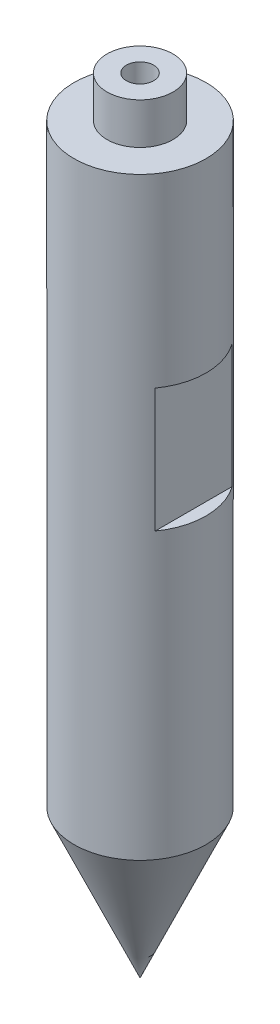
ISO-10303-21;
HEADER;
FILE_DESCRIPTION(('STEP AP214'),'2;1');
FILE_NAME('part.step','',(''),(''),'','','');
FILE_SCHEMA(('AUTOMOTIVE_DESIGN { 1 0 10303 214 1 1 1 1 }'));
ENDSEC;
DATA;
#1=APPLICATION_CONTEXT('core data for automotive mechanical design processes');
#2=APPLICATION_PROTOCOL_DEFINITION('international standard','automotive_design',2000,#1);
#3=PRODUCT_CONTEXT('',#1,'mechanical');
#4=PRODUCT('Part','Part','',(#3));
#5=PRODUCT_RELATED_PRODUCT_CATEGORY('part','',(#4));
#6=PRODUCT_DEFINITION_FORMATION('','',#4);
#7=PRODUCT_DEFINITION_CONTEXT('part definition',#1,'design');
#8=PRODUCT_DEFINITION('design','',#6,#7);
#9=PRODUCT_DEFINITION_SHAPE('','',#8);
#10=(LENGTH_UNIT() NAMED_UNIT(*) SI_UNIT(.MILLI.,.METRE.));
#11=(NAMED_UNIT(*) PLANE_ANGLE_UNIT() SI_UNIT($,.RADIAN.));
#12=(NAMED_UNIT(*) SI_UNIT($,.STERADIAN.) SOLID_ANGLE_UNIT());
#13=UNCERTAINTY_MEASURE_WITH_UNIT(LENGTH_MEASURE(1.E-05),#10,'distance_accuracy_value','');
#14=(GEOMETRIC_REPRESENTATION_CONTEXT(3) GLOBAL_UNCERTAINTY_ASSIGNED_CONTEXT((#13)) GLOBAL_UNIT_ASSIGNED_CONTEXT((#10,
#11,#12)) REPRESENTATION_CONTEXT('',''));
#15=CARTESIAN_POINT('',(0.,0.,0.));
#16=DIRECTION('',(0.,0.,1.));
#17=DIRECTION('',(1.,0.,0.));
#18=AXIS2_PLACEMENT_3D('',#15,#16,#17);
#19=CARTESIAN_POINT('',(0.,0.,0.));
#20=DIRECTION('',(0.,-1.,0.));
#21=DIRECTION('',(0.,0.,-1.));
#22=AXIS2_PLACEMENT_3D('',#19,#20,#21);
#23=PLANE('',#22);
#24=CARTESIAN_POINT('',(0.,0.,0.));
#25=DIRECTION('',(0.,1.,0.));
#26=DIRECTION('',(0.,0.,1.));
#27=AXIS2_PLACEMENT_3D('',#24,#25,#26);
#28=CIRCLE('',#27,4.);
#29=CARTESIAN_POINT('',(0.,0.,4.));
#30=VERTEX_POINT('',#29);
#31=EDGE_CURVE('E109',#30,#30,#28,.T.);
#32=ORIENTED_EDGE('',*,*,#31,.F.);
#33=EDGE_LOOP('',(#32));
#34=FACE_BOUND('',#33,.T.);
#35=CARTESIAN_POINT('',(0.,0.,0.));
#36=DIRECTION('',(0.,-1.,0.));
#37=DIRECTION('',(0.,0.,-1.));
#38=AXIS2_PLACEMENT_3D('',#35,#36,#37);
#39=CIRCLE('',#38,8.);
#40=CARTESIAN_POINT('',(0.,0.,-8.));
#41=VERTEX_POINT('',#40);
#42=EDGE_CURVE('E113',#41,#41,#39,.T.);
#43=ORIENTED_EDGE('',*,*,#42,.F.);
#44=EDGE_LOOP('',(#43));
#45=FACE_BOUND('',#44,.T.);
#46=ADVANCED_FACE('F38',(#34,#45),#23,.F.);
#47=CARTESIAN_POINT('',(0.,-90.,0.));
#48=DIRECTION('',(0.,-1.,0.));
#49=DIRECTION('',(0.,0.,-1.));
#50=AXIS2_PLACEMENT_3D('',#47,#48,#49);
#51=CYLINDRICAL_SURFACE('',#50,8.);
#52=DIRECTION('',(0.,-1.,0.));
#53=VECTOR('',#52,1.);
#54=CARTESIAN_POINT('',(6.50000000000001,-90.,4.66368952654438));
#55=LINE('',#54,#53);
#56=CARTESIAN_POINT('',(6.50000000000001,-37.5,4.66368952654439));
#57=VERTEX_POINT('',#56);
#58=CARTESIAN_POINT('',(6.50000000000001,-22.5,4.66368952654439));
#59=VERTEX_POINT('',#58);
#60=EDGE_CURVE('E132',#57,#59,#55,.F.);
#61=ORIENTED_EDGE('',*,*,#60,.T.);
#62=CARTESIAN_POINT('',(0.,-22.5,0.));
#63=DIRECTION('',(0.,1.,0.));
#64=DIRECTION('',(0.,0.,1.));
#65=AXIS2_PLACEMENT_3D('',#62,#63,#64);
#66=CIRCLE('',#65,8.);
#67=CARTESIAN_POINT('',(6.50000000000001,-22.5,-4.66368952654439));
#68=VERTEX_POINT('',#67);
#69=EDGE_CURVE('E11',#59,#68,#66,.T.);
#70=ORIENTED_EDGE('',*,*,#69,.T.);
#71=DIRECTION('',(0.,-1.,0.));
#72=VECTOR('',#71,1.);
#73=CARTESIAN_POINT('',(6.50000000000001,-90.,-4.66368952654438));
#74=LINE('',#73,#72);
#75=CARTESIAN_POINT('',(6.50000000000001,-37.5,-4.66368952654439));
#76=VERTEX_POINT('',#75);
#77=EDGE_CURVE('E45',#68,#76,#74,.T.);
#78=ORIENTED_EDGE('',*,*,#77,.T.);
#79=CARTESIAN_POINT('',(0.,-37.5,0.));
#80=DIRECTION('',(0.,-1.,0.));
#81=DIRECTION('',(1.,0.,0.));
#82=AXIS2_PLACEMENT_3D('',#79,#80,#81);
#83=CIRCLE('',#82,8.);
#84=EDGE_CURVE('E129',#76,#57,#83,.T.);
#85=ORIENTED_EDGE('',*,*,#84,.T.);
#86=EDGE_LOOP('',(#61,#70,#78,#85));
#87=FACE_BOUND('',#86,.T.);
#88=CARTESIAN_POINT('',(0.,-22.5,0.));
#89=DIRECTION('',(0.,1.,0.));
#90=DIRECTION('',(-1.,0.,0.));
#91=AXIS2_PLACEMENT_3D('',#88,#89,#90);
#92=CIRCLE('',#91,8.);
#93=CARTESIAN_POINT('',(-6.49999999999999,-22.5,-4.66368952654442));
#94=VERTEX_POINT('',#93);
#95=CARTESIAN_POINT('',(-6.49999999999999,-22.5,4.66368952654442));
#96=VERTEX_POINT('',#95);
#97=EDGE_CURVE('E120',#94,#96,#92,.T.);
#98=ORIENTED_EDGE('',*,*,#97,.T.);
#99=DIRECTION('',(0.,-1.,0.));
#100=VECTOR('',#99,1.);
#101=CARTESIAN_POINT('',(-6.49999999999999,-90.,4.66368952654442));
#102=LINE('',#101,#100);
#103=CARTESIAN_POINT('',(-6.49999999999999,-37.5,4.66368952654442));
#104=VERTEX_POINT('',#103);
#105=EDGE_CURVE('E126',#96,#104,#102,.T.);
#106=ORIENTED_EDGE('',*,*,#105,.T.);
#107=CARTESIAN_POINT('',(0.,-37.5,0.));
#108=DIRECTION('',(0.,-1.,0.));
#109=DIRECTION('',(1.,0.,0.));
#110=AXIS2_PLACEMENT_3D('',#107,#108,#109);
#111=CIRCLE('',#110,8.);
#112=CARTESIAN_POINT('',(-6.49999999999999,-37.5,-4.66368952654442));
#113=VERTEX_POINT('',#112);
#114=EDGE_CURVE('E123',#104,#113,#111,.T.);
#115=ORIENTED_EDGE('',*,*,#114,.T.);
#116=DIRECTION('',(0.,-1.,0.));
#117=VECTOR('',#116,1.);
#118=CARTESIAN_POINT('',(-6.49999999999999,-90.,-4.66368952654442));
#119=LINE('',#118,#117);
#120=EDGE_CURVE('E112',#113,#94,#119,.F.);
#121=ORIENTED_EDGE('',*,*,#120,.T.);
#122=EDGE_LOOP('',(#98,#106,#115,#121));
#123=FACE_BOUND('',#122,.T.);
#124=CARTESIAN_POINT('',(0.,-72.,0.));
#125=DIRECTION('',(0.,-1.,0.));
#126=DIRECTION('',(0.,0.,-1.));
#127=AXIS2_PLACEMENT_3D('',#124,#125,#126);
#128=CIRCLE('',#127,7.99999999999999);
#129=CARTESIAN_POINT('',(0.,-72.,-7.99999999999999));
#130=VERTEX_POINT('',#129);
#131=EDGE_CURVE('E108',#130,#130,#128,.T.);
#132=ORIENTED_EDGE('',*,*,#131,.F.);
#133=EDGE_LOOP('',(#132));
#134=FACE_BOUND('',#133,.T.);
#135=ORIENTED_EDGE('',*,*,#42,.T.);
#136=EDGE_LOOP('',(#135));
#137=FACE_BOUND('',#136,.T.);
#138=ADVANCED_FACE('F136',(#87,#123,#134,#137),#51,.T.);
#139=CARTESIAN_POINT('',(0.,-72.,0.));
#140=DIRECTION('',(0.,1.,0.));
#141=DIRECTION('',(0.,0.,1.));
#142=AXIS2_PLACEMENT_3D('',#139,#140,#141);
#143=CONICAL_SURFACE('',#142,7.99999999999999,0.418224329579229);
#144=CARTESIAN_POINT('',(0.,-90.,0.));
#145=VERTEX_POINT('',#144);
#146=VERTEX_LOOP('',#145);
#147=FACE_BOUND('',#146,.T.);
#148=ORIENTED_EDGE('',*,*,#131,.T.);
#149=EDGE_LOOP('',(#148));
#150=FACE_BOUND('',#149,.T.);
#151=ADVANCED_FACE('F157',(#147,#150),#143,.T.);
#152=CARTESIAN_POINT('',(0.,5.,0.));
#153=DIRECTION('',(0.,-1.,0.));
#154=DIRECTION('',(0.,0.,-1.));
#155=AXIS2_PLACEMENT_3D('',#152,#153,#154);
#156=CYLINDRICAL_SURFACE('',#155,4.);
#157=CARTESIAN_POINT('',(0.,5.,0.));
#158=DIRECTION('',(0.,1.,0.));
#159=DIRECTION('',(0.,0.,1.));
#160=AXIS2_PLACEMENT_3D('',#157,#158,#159);
#161=CIRCLE('',#160,4.);
#162=CARTESIAN_POINT('',(0.,5.,4.));
#163=VERTEX_POINT('',#162);
#164=EDGE_CURVE('E103',#163,#163,#161,.T.);
#165=ORIENTED_EDGE('',*,*,#164,.F.);
#166=EDGE_LOOP('',(#165));
#167=FACE_BOUND('',#166,.T.);
#168=ORIENTED_EDGE('',*,*,#31,.T.);
#169=EDGE_LOOP('',(#168));
#170=FACE_BOUND('',#169,.T.);
#171=ADVANCED_FACE('F163',(#167,#170),#156,.T.);
#172=CARTESIAN_POINT('',(0.,5.,0.));
#173=DIRECTION('',(0.,1.,0.));
#174=DIRECTION('',(0.,0.,1.));
#175=AXIS2_PLACEMENT_3D('',#172,#173,#174);
#176=PLANE('',#175);
#177=CARTESIAN_POINT('',(0.,5.,0.));
#178=DIRECTION('',(0.,1.,0.));
#179=DIRECTION('',(0.,0.,1.));
#180=AXIS2_PLACEMENT_3D('',#177,#178,#179);
#181=CIRCLE('',#180,1.65);
#182=CARTESIAN_POINT('',(0.,5.,1.65));
#183=VERTEX_POINT('',#182);
#184=EDGE_CURVE('E93',#183,#183,#181,.T.);
#185=ORIENTED_EDGE('',*,*,#184,.F.);
#186=EDGE_LOOP('',(#185));
#187=FACE_BOUND('',#186,.T.);
#188=ORIENTED_EDGE('',*,*,#164,.T.);
#189=EDGE_LOOP('',(#188));
#190=FACE_BOUND('',#189,.T.);
#191=ADVANCED_FACE('F165',(#187,#190),#176,.T.);
#192=CARTESIAN_POINT('',(-6.49999999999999,-37.5,-8.));
#193=DIRECTION('',(0.,-1.,0.));
#194=DIRECTION('',(1.,0.,0.));
#195=AXIS2_PLACEMENT_3D('',#192,#193,#194);
#196=PLANE('',#195);
#197=DIRECTION('',(0.,0.,1.));
#198=VECTOR('',#197,1.);
#199=CARTESIAN_POINT('',(-6.49999999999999,-37.5,-8.));
#200=LINE('',#199,#198);
#201=EDGE_CURVE('E92',#113,#104,#200,.T.);
#202=ORIENTED_EDGE('',*,*,#201,.F.);
#203=ORIENTED_EDGE('',*,*,#114,.F.);
#204=EDGE_LOOP('',(#202,#203));
#205=FACE_BOUND('',#204,.T.);
#206=ADVANCED_FACE('F172',(#205),#196,.F.);
#207=CARTESIAN_POINT('',(-6.49999999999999,-22.5,-8.));
#208=DIRECTION('',(0.,1.,0.));
#209=DIRECTION('',(-1.,0.,0.));
#210=AXIS2_PLACEMENT_3D('',#207,#208,#209);
#211=PLANE('',#210);
#212=DIRECTION('',(0.,0.,1.));
#213=VECTOR('',#212,1.);
#214=CARTESIAN_POINT('',(-6.49999999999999,-22.5,-8.));
#215=LINE('',#214,#213);
#216=EDGE_CURVE('E59',#94,#96,#215,.T.);
#217=ORIENTED_EDGE('',*,*,#216,.T.);
#218=ORIENTED_EDGE('',*,*,#97,.F.);
#219=EDGE_LOOP('',(#217,#218));
#220=FACE_BOUND('',#219,.T.);
#221=ADVANCED_FACE('F181',(#220),#211,.F.);
#222=CARTESIAN_POINT('',(-6.49999999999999,-22.5,-8.));
#223=DIRECTION('',(1.,0.,0.));
#224=DIRECTION('',(0.,1.,0.));
#225=AXIS2_PLACEMENT_3D('',#222,#223,#224);
#226=PLANE('',#225);
#227=ORIENTED_EDGE('',*,*,#216,.F.);
#228=ORIENTED_EDGE('',*,*,#120,.F.);
#229=ORIENTED_EDGE('',*,*,#201,.T.);
#230=ORIENTED_EDGE('',*,*,#105,.F.);
#231=EDGE_LOOP('',(#227,#228,#229,#230));
#232=FACE_BOUND('',#231,.T.);
#233=ADVANCED_FACE('F150',(#232),#226,.F.);
#234=CARTESIAN_POINT('',(6.50000000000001,-22.5,-8.));
#235=DIRECTION('',(-1.,0.,0.));
#236=DIRECTION('',(0.,-1.,0.));
#237=AXIS2_PLACEMENT_3D('',#234,#235,#236);
#238=PLANE('',#237);
#239=DIRECTION('',(0.,0.,1.));
#240=VECTOR('',#239,1.);
#241=CARTESIAN_POINT('',(6.50000000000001,-22.5,-8.));
#242=LINE('',#241,#240);
#243=EDGE_CURVE('E100',#68,#59,#242,.T.);
#244=ORIENTED_EDGE('',*,*,#243,.T.);
#245=ORIENTED_EDGE('',*,*,#60,.F.);
#246=DIRECTION('',(0.,0.,1.));
#247=VECTOR('',#246,1.);
#248=CARTESIAN_POINT('',(6.50000000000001,-37.5,-8.));
#249=LINE('',#248,#247);
#250=EDGE_CURVE('E51',#76,#57,#249,.T.);
#251=ORIENTED_EDGE('',*,*,#250,.F.);
#252=ORIENTED_EDGE('',*,*,#77,.F.);
#253=EDGE_LOOP('',(#244,#245,#251,#252));
#254=FACE_BOUND('',#253,.T.);
#255=ADVANCED_FACE('F140',(#254),#238,.F.);
#256=CARTESIAN_POINT('',(6.50000000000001,-22.5,-8.));
#257=DIRECTION('',(0.,1.,0.));
#258=DIRECTION('',(0.,0.,1.));
#259=AXIS2_PLACEMENT_3D('',#256,#257,#258);
#260=PLANE('',#259);
#261=ORIENTED_EDGE('',*,*,#243,.F.);
#262=ORIENTED_EDGE('',*,*,#69,.F.);
#263=EDGE_LOOP('',(#261,#262));
#264=FACE_BOUND('',#263,.T.);
#265=ADVANCED_FACE('F142',(#264),#260,.F.);
#266=CARTESIAN_POINT('',(6.50000000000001,-37.5,-8.));
#267=DIRECTION('',(0.,-1.,0.));
#268=DIRECTION('',(1.,0.,0.));
#269=AXIS2_PLACEMENT_3D('',#266,#267,#268);
#270=PLANE('',#269);
#271=ORIENTED_EDGE('',*,*,#250,.T.);
#272=ORIENTED_EDGE('',*,*,#84,.F.);
#273=EDGE_LOOP('',(#271,#272));
#274=FACE_BOUND('',#273,.T.);
#275=ADVANCED_FACE('F86',(#274),#270,.F.);
#276=CARTESIAN_POINT('',(0.,-5.1,0.));
#277=DIRECTION('',(0.,1.,0.));
#278=DIRECTION('',(0.,0.,1.));
#279=AXIS2_PLACEMENT_3D('',#276,#277,#278);
#280=CONICAL_SURFACE('',#279,1.65,1.02974425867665);
#281=CARTESIAN_POINT('',(0.,-6.09142002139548,0.));
#282=VERTEX_POINT('',#281);
#283=VERTEX_LOOP('',#282);
#284=FACE_BOUND('',#283,.T.);
#285=CARTESIAN_POINT('',(0.,-5.1,0.));
#286=DIRECTION('',(0.,1.,0.));
#287=DIRECTION('',(0.,0.,1.));
#288=AXIS2_PLACEMENT_3D('',#285,#286,#287);
#289=CIRCLE('',#288,1.65);
#290=CARTESIAN_POINT('',(0.,-5.1,1.65));
#291=VERTEX_POINT('',#290);
#292=EDGE_CURVE('E90',#291,#291,#289,.T.);
#293=ORIENTED_EDGE('',*,*,#292,.T.);
#294=EDGE_LOOP('',(#293));
#295=FACE_BOUND('',#294,.T.);
#296=ADVANCED_FACE('F82',(#284,#295),#280,.F.);
#297=CARTESIAN_POINT('',(0.,5.,0.));
#298=DIRECTION('',(0.,1.,0.));
#299=DIRECTION('',(0.,0.,1.));
#300=AXIS2_PLACEMENT_3D('',#297,#298,#299);
#301=CYLINDRICAL_SURFACE('',#300,1.65);
#302=ORIENTED_EDGE('',*,*,#292,.F.);
#303=EDGE_LOOP('',(#302));
#304=FACE_BOUND('',#303,.T.);
#305=ORIENTED_EDGE('',*,*,#184,.T.);
#306=EDGE_LOOP('',(#305));
#307=FACE_BOUND('',#306,.T.);
#308=ADVANCED_FACE('F85',(#304,#307),#301,.F.);
#309=CLOSED_SHELL('',(#46,#138,#151,#171,#191,#206,#221,#233,#255,#265,#275,#296,#308));
#310=MANIFOLD_SOLID_BREP('B2',#309);
#311=ADVANCED_BREP_SHAPE_REPRESENTATION('',(#18,#310),#14);
#312=SHAPE_DEFINITION_REPRESENTATION(#9,#311);
ENDSEC;
END-ISO-10303-21;
